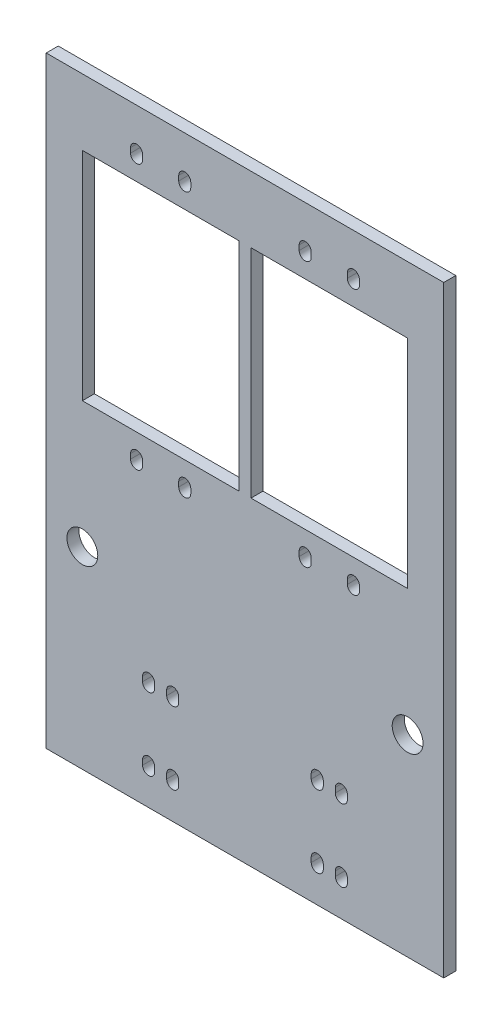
from build123d import *

# Parameters (mm, degrees)
SKETCH1_W           = 209.55
SKETCH1_H           = 317.5
BOSS_EXTRUDE1_DEPTH = 6.35
SKETCH2_W           = 82.55
SKETCH2_H           = 114.3
SKETCH2_R           = 8.128
CUT_EXTRUDE2_DEPTH  = 6.35


with BuildPart() as part:
    # Sketch1 → Boss-Extrude1 (new body)
    with BuildSketch(Plane.XY):
        Rectangle(SKETCH1_W, SKETCH1_H)
    extrude(amount=BOSS_EXTRUDE1_DEPTH)

    # Sketch2 → Cut-Extrude2 (cut)
    with BuildSketch(Plane.XY.offset(6.35)):
        with BuildLine():
            Line((47.625, -138.43), (47.625, -139.7))
            Line((47.625, -139.7), (47.625, -140.97))
            ThreePointArc((47.625, -140.97), (50.8, -144.145), (53.975, -140.97))
            Line((53.975, -140.97), (53.975, -138.43))
            ThreePointArc((53.975, -138.43), (50.8, -135.255), (47.625, -138.43))
        make_face()
        with BuildLine():
            Line((41.275, -140.97), (41.275, -139.7))
            Line((41.275, -139.7), (41.275, -138.43))
            ThreePointArc((41.275, -138.43), (38.1, -135.255), (34.925, -138.43))
            Line((34.925, -138.43), (34.925, -140.97))
            ThreePointArc((34.925, -140.97), (38.1, -144.145), (41.275, -140.97))
        make_face()
        with BuildLine():
            Line((-53.975, -100.33), (-53.975, -102.87))
            ThreePointArc((-53.975, -102.87), (-50.8, -106.045), (-47.625, -102.87))
            Line((-47.625, -102.87), (-47.625, -100.33))
            ThreePointArc((-47.625, -100.33), (-50.8, -97.155), (-53.975, -100.33))
        make_face()
        with BuildLine():
            ThreePointArc((-41.275, -102.87), (-38.1, -106.045), (-34.925, -102.87))
            Line((-34.925, -102.87), (-34.925, -100.33))
            ThreePointArc((-34.925, -100.33), (-38.1, -97.155), (-41.275, -100.33))
            Line((-41.275, -100.33), (-41.275, -102.87))
        make_face()
        with BuildLine():
            Line((-34.925, -140.97), (-34.925, -138.43))
            ThreePointArc((-34.925, -138.43), (-38.1, -135.255), (-41.275, -138.43))
            Line((-41.275, -138.43), (-41.275, -140.97))
            ThreePointArc((-41.275, -140.97), (-38.1, -144.145), (-34.925, -140.97))
        make_face()
        with BuildLine():
            ThreePointArc((-47.625, -138.43), (-50.8, -135.255), (-53.975, -138.43))
            Line((-53.975, -138.43), (-53.975, -140.97))
            ThreePointArc((-53.975, -140.97), (-50.8, -144.145), (-47.625, -140.97))
            Line((-47.625, -140.97), (-47.625, -138.43))
        make_face()
        with BuildLine():
            Line((34.925, -100.33), (34.925, -102.87))
            ThreePointArc((34.925, -102.87), (38.1, -106.045), (41.275, -102.87))
            Line((41.275, -102.87), (41.275, -100.33))
            ThreePointArc((41.275, -100.33), (38.1, -97.155), (34.925, -100.33))
        make_face()
        with BuildLine():
            ThreePointArc((47.625, -102.87), (50.8, -106.045), (53.975, -102.87))
            Line((53.975, -102.87), (53.975, -100.33))
            ThreePointArc((53.975, -100.33), (50.8, -97.155), (47.625, -100.33))
            Line((47.625, -100.33), (47.625, -102.87))
        make_face()
        with Locations((-44.45, 66.675)):
            Rectangle(SKETCH2_W, SKETCH2_H)
        with BuildLine():
            Line((-28.575, 135.255), (-28.575, 137.795))
            ThreePointArc((-28.575, 137.795), (-31.75, 140.97), (-34.925, 137.795))
            Line((-34.925, 137.795), (-34.925, 135.255))
            ThreePointArc((-34.925, 135.255), (-31.75, 132.08), (-28.575, 135.255))
        make_face()
        with BuildLine():
            ThreePointArc((-53.975, 137.795), (-57.15, 140.97), (-60.325, 137.795))
            Line((-60.325, 137.795), (-60.325, 135.255))
            ThreePointArc((-60.325, 135.255), (-57.15, 132.08), (-53.975, 135.255))
            Line((-53.975, 135.255), (-53.975, 137.795))
        make_face()
        with BuildLine():
            ThreePointArc((-34.925, -4.445), (-31.75, -7.62), (-28.575, -4.445))
            Line((-28.575, -4.445), (-28.575, -1.905))
            ThreePointArc((-28.575, -1.905), (-31.75, 1.27), (-34.925, -1.905))
            Line((-34.925, -1.905), (-34.925, -4.445))
        make_face()
        with BuildLine():
            Line((-60.325, -1.905), (-60.325, -4.445))
            ThreePointArc((-60.325, -4.445), (-57.15, -7.62), (-53.975, -4.445))
            Line((-53.975, -4.445), (-53.975, -1.905))
            ThreePointArc((-53.975, -1.905), (-57.15, 1.27), (-60.325, -1.905))
        make_face()
        with BuildLine():
            Line((28.575, -1.905), (28.575, -4.445))
            ThreePointArc((28.575, -4.445), (31.75, -7.62), (34.925, -4.445))
            Line((34.925, -4.445), (34.925, -1.905))
            ThreePointArc((34.925, -1.905), (31.75, 1.27), (28.575, -1.905))
        make_face()
        with BuildLine():
            ThreePointArc((53.975, -4.445), (57.15, -7.62), (60.325, -4.445))
            Line((60.325, -4.445), (60.325, -1.905))
            ThreePointArc((60.325, -1.905), (57.15, 1.27), (53.975, -1.905))
            Line((53.975, -1.905), (53.975, -4.445))
        make_face()
        with Locations((44.45, 66.675)):
            Rectangle(SKETCH2_W, SKETCH2_H)
        with BuildLine():
            ThreePointArc((34.925, 137.795), (31.75, 140.97), (28.575, 137.795))
            Line((28.575, 137.795), (28.575, 135.255))
            ThreePointArc((28.575, 135.255), (31.75, 132.08), (34.925, 135.255))
            Line((34.925, 135.255), (34.925, 137.795))
        make_face()
        with BuildLine():
            Line((60.325, 135.255), (60.325, 137.795))
            ThreePointArc((60.325, 137.795), (57.15, 140.97), (53.975, 137.795))
            Line((53.975, 137.795), (53.975, 135.255))
            ThreePointArc((53.975, 135.255), (57.15, 132.08), (60.325, 135.255))
        make_face()
        with Locations((-85.725, -57.15)):
            Circle(SKETCH2_R)
        with Locations((85.725, -57.15)):
            Circle(SKETCH2_R)
    extrude(amount=-CUT_EXTRUDE2_DEPTH, mode=Mode.SUBTRACT)


solid = part.part
